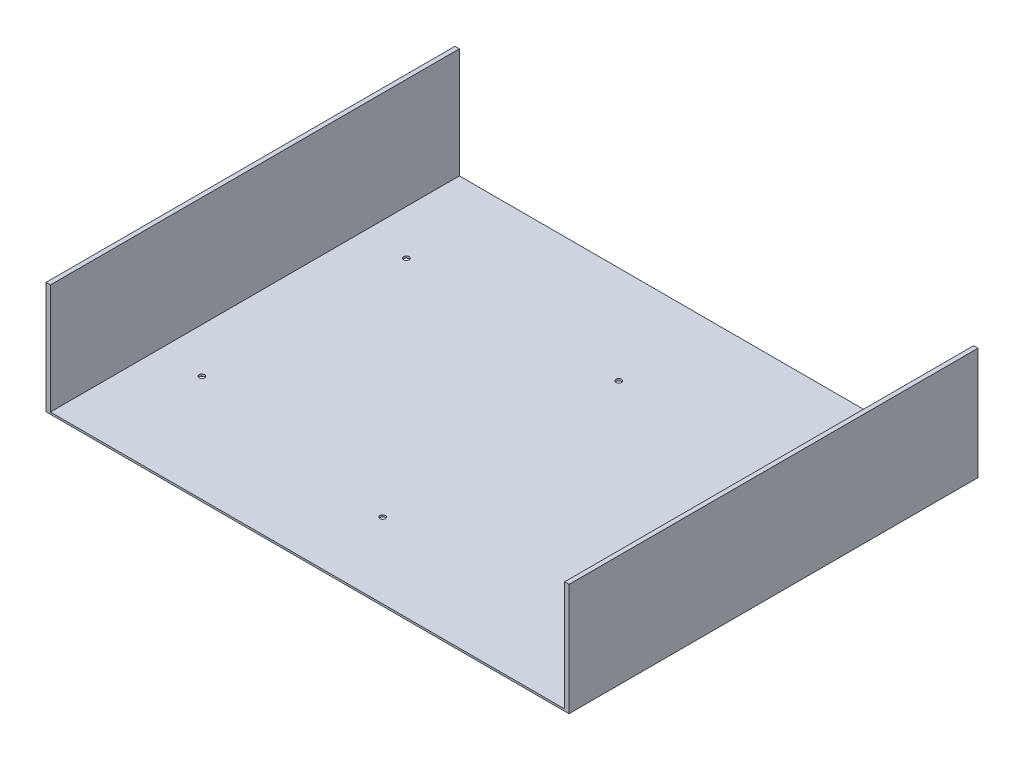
ISO-10303-21;
HEADER;
FILE_DESCRIPTION(('STEP AP214'),'2;1');
FILE_NAME('part.step','',(''),(''),'','','');
FILE_SCHEMA(('AUTOMOTIVE_DESIGN { 1 0 10303 214 1 1 1 1 }'));
ENDSEC;
DATA;
#1=APPLICATION_CONTEXT('core data for automotive mechanical design processes');
#2=APPLICATION_PROTOCOL_DEFINITION('international standard','automotive_design',2000,#1);
#3=PRODUCT_CONTEXT('',#1,'mechanical');
#4=PRODUCT('Part','Part','',(#3));
#5=PRODUCT_RELATED_PRODUCT_CATEGORY('part','',(#4));
#6=PRODUCT_DEFINITION_FORMATION('','',#4);
#7=PRODUCT_DEFINITION_CONTEXT('part definition',#1,'design');
#8=PRODUCT_DEFINITION('design','',#6,#7);
#9=PRODUCT_DEFINITION_SHAPE('','',#8);
#10=(LENGTH_UNIT() NAMED_UNIT(*) SI_UNIT(.MILLI.,.METRE.));
#11=(NAMED_UNIT(*) PLANE_ANGLE_UNIT() SI_UNIT($,.RADIAN.));
#12=(NAMED_UNIT(*) SI_UNIT($,.STERADIAN.) SOLID_ANGLE_UNIT());
#13=UNCERTAINTY_MEASURE_WITH_UNIT(LENGTH_MEASURE(1.E-05),#10,'distance_accuracy_value','');
#14=(GEOMETRIC_REPRESENTATION_CONTEXT(3) GLOBAL_UNCERTAINTY_ASSIGNED_CONTEXT((#13)) GLOBAL_UNIT_ASSIGNED_CONTEXT((#10,
#11,#12)) REPRESENTATION_CONTEXT('',''));
#15=CARTESIAN_POINT('',(0.,0.,0.));
#16=DIRECTION('',(0.,0.,1.));
#17=DIRECTION('',(1.,0.,0.));
#18=AXIS2_PLACEMENT_3D('',#15,#16,#17);
#19=CARTESIAN_POINT('',(0.,1.5875,0.));
#20=DIRECTION('',(0.,-1.,0.));
#21=DIRECTION('',(0.,0.,-1.));
#22=AXIS2_PLACEMENT_3D('',#19,#20,#21);
#23=PLANE('',#22);
#24=CARTESIAN_POINT('',(39.6875,1.5875,-251.2822));
#25=DIRECTION('',(0.,1.,0.));
#26=DIRECTION('',(0.,0.,1.));
#27=AXIS2_PLACEMENT_3D('',#24,#25,#26);
#28=CIRCLE('',#27,2.24789999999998);
#29=CARTESIAN_POINT('',(39.6875,1.5875,-249.0343));
#30=VERTEX_POINT('',#29);
#31=EDGE_CURVE('E350',#30,#30,#28,.T.);
#32=ORIENTED_EDGE('',*,*,#31,.F.);
#33=EDGE_LOOP('',(#32));
#34=FACE_BOUND('',#33,.T.);
#35=CARTESIAN_POINT('',(211.1375,1.5875,-251.2822));
#36=DIRECTION('',(0.,1.,0.));
#37=DIRECTION('',(0.,0.,1.));
#38=AXIS2_PLACEMENT_3D('',#35,#36,#37);
#39=CIRCLE('',#38,2.2479);
#40=CARTESIAN_POINT('',(211.1375,1.5875,-249.0343));
#41=VERTEX_POINT('',#40);
#42=EDGE_CURVE('E352',#41,#41,#39,.T.);
#43=ORIENTED_EDGE('',*,*,#42,.F.);
#44=EDGE_LOOP('',(#43));
#45=FACE_BOUND('',#44,.T.);
#46=CARTESIAN_POINT('',(382.5875,1.5875,-251.2822));
#47=DIRECTION('',(0.,1.,0.));
#48=DIRECTION('',(0.,0.,1.));
#49=AXIS2_PLACEMENT_3D('',#46,#47,#48);
#50=CIRCLE('',#49,2.24789999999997);
#51=CARTESIAN_POINT('',(382.5875,1.5875,-249.0343));
#52=VERTEX_POINT('',#51);
#53=EDGE_CURVE('E360',#52,#52,#50,.T.);
#54=ORIENTED_EDGE('',*,*,#53,.F.);
#55=EDGE_LOOP('',(#54));
#56=FACE_BOUND('',#55,.T.);
#57=CARTESIAN_POINT('',(382.5875,1.5875,-60.7822000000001));
#58=DIRECTION('',(0.,1.,0.));
#59=DIRECTION('',(0.,0.,1.));
#60=AXIS2_PLACEMENT_3D('',#57,#58,#59);
#61=CIRCLE('',#60,2.24789999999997);
#62=CARTESIAN_POINT('',(382.5875,1.5875,-58.5343000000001));
#63=VERTEX_POINT('',#62);
#64=EDGE_CURVE('E366',#63,#63,#61,.T.);
#65=ORIENTED_EDGE('',*,*,#64,.F.);
#66=EDGE_LOOP('',(#65));
#67=FACE_BOUND('',#66,.T.);
#68=CARTESIAN_POINT('',(211.1375,1.5875,-60.7822));
#69=DIRECTION('',(0.,1.,0.));
#70=DIRECTION('',(0.,0.,1.));
#71=AXIS2_PLACEMENT_3D('',#68,#69,#70);
#72=CIRCLE('',#71,2.2479);
#73=CARTESIAN_POINT('',(211.1375,1.5875,-58.5343));
#74=VERTEX_POINT('',#73);
#75=EDGE_CURVE('E372',#74,#74,#72,.T.);
#76=ORIENTED_EDGE('',*,*,#75,.F.);
#77=EDGE_LOOP('',(#76));
#78=FACE_BOUND('',#77,.T.);
#79=CARTESIAN_POINT('',(39.6875,1.5875,-86.1822));
#80=DIRECTION('',(0.,1.,0.));
#81=DIRECTION('',(0.,0.,1.));
#82=AXIS2_PLACEMENT_3D('',#79,#80,#81);
#83=CIRCLE('',#82,2.24789999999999);
#84=CARTESIAN_POINT('',(39.6875,1.5875,-83.9343));
#85=VERTEX_POINT('',#84);
#86=EDGE_CURVE('E377',#85,#85,#83,.T.);
#87=ORIENTED_EDGE('',*,*,#86,.F.);
#88=EDGE_LOOP('',(#87));
#89=FACE_BOUND('',#88,.T.);
#90=DIRECTION('',(0.,0.,1.));
#91=VECTOR('',#90,1.);
#92=CARTESIAN_POINT('',(418.719,1.5875,-330.2));
#93=LINE('',#92,#91);
#94=CARTESIAN_POINT('',(418.719,1.5875,-330.2));
#95=VERTEX_POINT('',#94);
#96=CARTESIAN_POINT('',(418.719,1.5875,0.));
#97=VERTEX_POINT('',#96);
#98=EDGE_CURVE('E124',#95,#97,#93,.T.);
#99=ORIENTED_EDGE('',*,*,#98,.F.);
#100=DIRECTION('',(-1.,0.,0.));
#101=VECTOR('',#100,1.);
#102=CARTESIAN_POINT('',(0.,1.5875,-330.2));
#103=LINE('',#102,#101);
#104=CARTESIAN_POINT('',(3.556,1.5875,-330.2));
#105=VERTEX_POINT('',#104);
#106=EDGE_CURVE('E156',#95,#105,#103,.T.);
#107=ORIENTED_EDGE('',*,*,#106,.T.);
#108=DIRECTION('',(0.,0.,-1.));
#109=VECTOR('',#108,1.);
#110=CARTESIAN_POINT('',(3.556,1.5875,-330.2));
#111=LINE('',#110,#109);
#112=CARTESIAN_POINT('',(3.55600000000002,1.5875,0.));
#113=VERTEX_POINT('',#112);
#114=EDGE_CURVE('E55',#113,#105,#111,.T.);
#115=ORIENTED_EDGE('',*,*,#114,.F.);
#116=DIRECTION('',(1.,0.,0.));
#117=VECTOR('',#116,1.);
#118=CARTESIAN_POINT('',(0.,1.5875,0.));
#119=LINE('',#118,#117);
#120=EDGE_CURVE('E50',#113,#97,#119,.T.);
#121=ORIENTED_EDGE('',*,*,#120,.T.);
#122=EDGE_LOOP('',(#99,#107,#115,#121));
#123=FACE_BOUND('',#122,.T.);
#124=ADVANCED_FACE('F35',(#34,#45,#56,#67,#78,#89,#123),#23,.F.);
#125=CARTESIAN_POINT('',(0.,1.5875,0.));
#126=DIRECTION('',(1.,0.,0.));
#127=DIRECTION('',(0.,0.,-1.));
#128=AXIS2_PLACEMENT_3D('',#125,#126,#127);
#129=PLANE('',#128);
#130=DIRECTION('',(0.,0.,1.));
#131=VECTOR('',#130,1.);
#132=CARTESIAN_POINT('',(0.,0.,0.));
#133=LINE('',#132,#131);
#134=CARTESIAN_POINT('',(0.,0.,-330.2));
#135=VERTEX_POINT('',#134);
#136=CARTESIAN_POINT('',(0.,0.,0.));
#137=VERTEX_POINT('',#136);
#138=EDGE_CURVE('E154',#135,#137,#133,.T.);
#139=ORIENTED_EDGE('',*,*,#138,.T.);
#140=DIRECTION('',(0.,-1.,0.));
#141=VECTOR('',#140,1.);
#142=CARTESIAN_POINT('',(0.,1.5875,0.));
#143=LINE('',#142,#141);
#144=CARTESIAN_POINT('',(0.,90.4875,0.));
#145=VERTEX_POINT('',#144);
#146=EDGE_CURVE('E11',#145,#137,#143,.T.);
#147=ORIENTED_EDGE('',*,*,#146,.F.);
#148=DIRECTION('',(0.,0.,1.));
#149=VECTOR('',#148,1.);
#150=CARTESIAN_POINT('',(0.,90.4875,-330.2));
#151=LINE('',#150,#149);
#152=CARTESIAN_POINT('',(0.,90.4875,-330.2));
#153=VERTEX_POINT('',#152);
#154=EDGE_CURVE('E137',#153,#145,#151,.T.);
#155=ORIENTED_EDGE('',*,*,#154,.F.);
#156=DIRECTION('',(0.,-1.,0.));
#157=VECTOR('',#156,1.);
#158=CARTESIAN_POINT('',(0.,1.5875,-330.2));
#159=LINE('',#158,#157);
#160=EDGE_CURVE('E109',#153,#135,#159,.T.);
#161=ORIENTED_EDGE('',*,*,#160,.T.);
#162=EDGE_LOOP('',(#139,#147,#155,#161));
#163=FACE_BOUND('',#162,.T.);
#164=ADVANCED_FACE('F37',(#163),#129,.F.);
#165=CARTESIAN_POINT('',(0.,1.5875,0.));
#166=DIRECTION('',(0.,0.,-1.));
#167=DIRECTION('',(-1.,0.,0.));
#168=AXIS2_PLACEMENT_3D('',#165,#166,#167);
#169=PLANE('',#168);
#170=DIRECTION('',(1.,0.,0.));
#171=VECTOR('',#170,1.);
#172=CARTESIAN_POINT('',(0.,0.,0.));
#173=LINE('',#172,#171);
#174=CARTESIAN_POINT('',(422.275,0.,0.));
#175=VERTEX_POINT('',#174);
#176=EDGE_CURVE('E161',#137,#175,#173,.T.);
#177=ORIENTED_EDGE('',*,*,#176,.T.);
#178=DIRECTION('',(0.,-1.,0.));
#179=VECTOR('',#178,1.);
#180=CARTESIAN_POINT('',(422.275,1.5875,0.));
#181=LINE('',#180,#179);
#182=CARTESIAN_POINT('',(422.275,90.4875,0.));
#183=VERTEX_POINT('',#182);
#184=EDGE_CURVE('E43',#183,#175,#181,.T.);
#185=ORIENTED_EDGE('',*,*,#184,.F.);
#186=DIRECTION('',(1.,0.,0.));
#187=VECTOR('',#186,1.);
#188=CARTESIAN_POINT('',(422.275,90.4875,0.));
#189=LINE('',#188,#187);
#190=CARTESIAN_POINT('',(418.719,90.4875,0.));
#191=VERTEX_POINT('',#190);
#192=EDGE_CURVE('E123',#191,#183,#189,.T.);
#193=ORIENTED_EDGE('',*,*,#192,.F.);
#194=DIRECTION('',(0.,-1.,0.));
#195=VECTOR('',#194,1.);
#196=CARTESIAN_POINT('',(418.719,90.4875,0.));
#197=LINE('',#196,#195);
#198=EDGE_CURVE('E132',#191,#97,#197,.T.);
#199=ORIENTED_EDGE('',*,*,#198,.T.);
#200=ORIENTED_EDGE('',*,*,#120,.F.);
#201=DIRECTION('',(0.,-1.,0.));
#202=VECTOR('',#201,1.);
#203=CARTESIAN_POINT('',(3.55600000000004,90.4875,0.));
#204=LINE('',#203,#202);
#205=CARTESIAN_POINT('',(3.55600000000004,90.4875,0.));
#206=VERTEX_POINT('',#205);
#207=EDGE_CURVE('E151',#206,#113,#204,.T.);
#208=ORIENTED_EDGE('',*,*,#207,.F.);
#209=DIRECTION('',(1.,0.,0.));
#210=VECTOR('',#209,1.);
#211=CARTESIAN_POINT('',(0.,90.4875,0.));
#212=LINE('',#211,#210);
#213=EDGE_CURVE('E140',#145,#206,#212,.T.);
#214=ORIENTED_EDGE('',*,*,#213,.F.);
#215=ORIENTED_EDGE('',*,*,#146,.T.);
#216=EDGE_LOOP('',(#177,#185,#193,#199,#200,#208,#214,#215));
#217=FACE_BOUND('',#216,.T.);
#218=ADVANCED_FACE('F181',(#217),#169,.F.);
#219=CARTESIAN_POINT('',(422.275,1.5875,0.));
#220=DIRECTION('',(-1.,0.,0.));
#221=DIRECTION('',(0.,0.,1.));
#222=AXIS2_PLACEMENT_3D('',#219,#220,#221);
#223=PLANE('',#222);
#224=DIRECTION('',(0.,0.,-1.));
#225=VECTOR('',#224,1.);
#226=CARTESIAN_POINT('',(422.275,0.,0.));
#227=LINE('',#226,#225);
#228=CARTESIAN_POINT('',(422.275,0.,-330.2));
#229=VERTEX_POINT('',#228);
#230=EDGE_CURVE('E106',#175,#229,#227,.T.);
#231=ORIENTED_EDGE('',*,*,#230,.T.);
#232=DIRECTION('',(0.,-1.,0.));
#233=VECTOR('',#232,1.);
#234=CARTESIAN_POINT('',(422.275,1.5875,-330.2));
#235=LINE('',#234,#233);
#236=CARTESIAN_POINT('',(422.275,90.4875,-330.2));
#237=VERTEX_POINT('',#236);
#238=EDGE_CURVE('E99',#237,#229,#235,.T.);
#239=ORIENTED_EDGE('',*,*,#238,.F.);
#240=DIRECTION('',(0.,0.,-1.));
#241=VECTOR('',#240,1.);
#242=CARTESIAN_POINT('',(422.275,90.4875,-330.2));
#243=LINE('',#242,#241);
#244=EDGE_CURVE('E104',#183,#237,#243,.T.);
#245=ORIENTED_EDGE('',*,*,#244,.F.);
#246=ORIENTED_EDGE('',*,*,#184,.T.);
#247=EDGE_LOOP('',(#231,#239,#245,#246));
#248=FACE_BOUND('',#247,.T.);
#249=ADVANCED_FACE('F101',(#248),#223,.F.);
#250=CARTESIAN_POINT('',(0.,1.5875,-330.2));
#251=DIRECTION('',(0.,0.,1.));
#252=DIRECTION('',(1.,0.,0.));
#253=AXIS2_PLACEMENT_3D('',#250,#251,#252);
#254=PLANE('',#253);
#255=DIRECTION('',(-1.,0.,0.));
#256=VECTOR('',#255,1.);
#257=CARTESIAN_POINT('',(0.,0.,-330.2));
#258=LINE('',#257,#256);
#259=EDGE_CURVE('E157',#229,#135,#258,.T.);
#260=ORIENTED_EDGE('',*,*,#259,.T.);
#261=ORIENTED_EDGE('',*,*,#160,.F.);
#262=DIRECTION('',(-1.,0.,0.));
#263=VECTOR('',#262,1.);
#264=CARTESIAN_POINT('',(0.,90.4875,-330.2));
#265=LINE('',#264,#263);
#266=CARTESIAN_POINT('',(3.556,90.4875,-330.2));
#267=VERTEX_POINT('',#266);
#268=EDGE_CURVE('E144',#267,#153,#265,.T.);
#269=ORIENTED_EDGE('',*,*,#268,.F.);
#270=DIRECTION('',(0.,-1.,0.));
#271=VECTOR('',#270,1.);
#272=CARTESIAN_POINT('',(3.556,90.4875,-330.2));
#273=LINE('',#272,#271);
#274=EDGE_CURVE('E147',#267,#105,#273,.T.);
#275=ORIENTED_EDGE('',*,*,#274,.T.);
#276=ORIENTED_EDGE('',*,*,#106,.F.);
#277=DIRECTION('',(0.,-1.,0.));
#278=VECTOR('',#277,1.);
#279=CARTESIAN_POINT('',(418.719,90.4875,-330.2));
#280=LINE('',#279,#278);
#281=CARTESIAN_POINT('',(418.719,90.4875,-330.2));
#282=VERTEX_POINT('',#281);
#283=EDGE_CURVE('E115',#282,#95,#280,.T.);
#284=ORIENTED_EDGE('',*,*,#283,.F.);
#285=DIRECTION('',(-1.,0.,0.));
#286=VECTOR('',#285,1.);
#287=CARTESIAN_POINT('',(422.275,90.4875,-330.2));
#288=LINE('',#287,#286);
#289=EDGE_CURVE('E112',#237,#282,#288,.T.);
#290=ORIENTED_EDGE('',*,*,#289,.F.);
#291=ORIENTED_EDGE('',*,*,#238,.T.);
#292=EDGE_LOOP('',(#260,#261,#269,#275,#276,#284,#290,#291));
#293=FACE_BOUND('',#292,.T.);
#294=ADVANCED_FACE('F113',(#293),#254,.F.);
#295=CARTESIAN_POINT('',(0.,0.,0.));
#296=DIRECTION('',(0.,-1.,0.));
#297=DIRECTION('',(0.,0.,-1.));
#298=AXIS2_PLACEMENT_3D('',#295,#296,#297);
#299=PLANE('',#298);
#300=CARTESIAN_POINT('',(39.6875,0.,-251.2822));
#301=DIRECTION('',(0.,1.,0.));
#302=DIRECTION('',(0.,0.,1.));
#303=AXIS2_PLACEMENT_3D('',#300,#301,#302);
#304=CIRCLE('',#303,2.2479);
#305=CARTESIAN_POINT('',(39.6875,0.,-249.0343));
#306=VERTEX_POINT('',#305);
#307=EDGE_CURVE('E348',#306,#306,#304,.T.);
#308=ORIENTED_EDGE('',*,*,#307,.T.);
#309=EDGE_LOOP('',(#308));
#310=FACE_BOUND('',#309,.T.);
#311=CARTESIAN_POINT('',(211.1375,0.,-251.2822));
#312=DIRECTION('',(0.,1.,0.));
#313=DIRECTION('',(0.,0.,1.));
#314=AXIS2_PLACEMENT_3D('',#311,#312,#313);
#315=CIRCLE('',#314,2.2479);
#316=CARTESIAN_POINT('',(211.1375,0.,-249.0343));
#317=VERTEX_POINT('',#316);
#318=EDGE_CURVE('E357',#317,#317,#315,.T.);
#319=ORIENTED_EDGE('',*,*,#318,.T.);
#320=EDGE_LOOP('',(#319));
#321=FACE_BOUND('',#320,.T.);
#322=CARTESIAN_POINT('',(382.5875,0.,-251.2822));
#323=DIRECTION('',(0.,1.,0.));
#324=DIRECTION('',(0.,0.,1.));
#325=AXIS2_PLACEMENT_3D('',#322,#323,#324);
#326=CIRCLE('',#325,2.24789999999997);
#327=CARTESIAN_POINT('',(382.5875,0.,-249.0343));
#328=VERTEX_POINT('',#327);
#329=EDGE_CURVE('E363',#328,#328,#326,.T.);
#330=ORIENTED_EDGE('',*,*,#329,.T.);
#331=EDGE_LOOP('',(#330));
#332=FACE_BOUND('',#331,.T.);
#333=CARTESIAN_POINT('',(382.5875,0.,-60.7822000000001));
#334=DIRECTION('',(0.,1.,0.));
#335=DIRECTION('',(0.,0.,1.));
#336=AXIS2_PLACEMENT_3D('',#333,#334,#335);
#337=CIRCLE('',#336,2.24789999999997);
#338=CARTESIAN_POINT('',(382.5875,0.,-58.5343000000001));
#339=VERTEX_POINT('',#338);
#340=EDGE_CURVE('E369',#339,#339,#337,.T.);
#341=ORIENTED_EDGE('',*,*,#340,.T.);
#342=EDGE_LOOP('',(#341));
#343=FACE_BOUND('',#342,.T.);
#344=CARTESIAN_POINT('',(211.1375,0.,-60.7822));
#345=DIRECTION('',(0.,1.,0.));
#346=DIRECTION('',(0.,0.,1.));
#347=AXIS2_PLACEMENT_3D('',#344,#345,#346);
#348=CIRCLE('',#347,2.2479);
#349=CARTESIAN_POINT('',(211.1375,0.,-58.5343));
#350=VERTEX_POINT('',#349);
#351=EDGE_CURVE('E375',#350,#350,#348,.T.);
#352=ORIENTED_EDGE('',*,*,#351,.T.);
#353=EDGE_LOOP('',(#352));
#354=FACE_BOUND('',#353,.T.);
#355=CARTESIAN_POINT('',(39.6875,0.,-86.1822));
#356=DIRECTION('',(0.,1.,0.));
#357=DIRECTION('',(0.,0.,1.));
#358=AXIS2_PLACEMENT_3D('',#355,#356,#357);
#359=CIRCLE('',#358,2.2479);
#360=CARTESIAN_POINT('',(39.6875,0.,-83.9343));
#361=VERTEX_POINT('',#360);
#362=EDGE_CURVE('E126',#361,#361,#359,.T.);
#363=ORIENTED_EDGE('',*,*,#362,.T.);
#364=EDGE_LOOP('',(#363));
#365=FACE_BOUND('',#364,.T.);
#366=ORIENTED_EDGE('',*,*,#138,.F.);
#367=ORIENTED_EDGE('',*,*,#259,.F.);
#368=ORIENTED_EDGE('',*,*,#230,.F.);
#369=ORIENTED_EDGE('',*,*,#176,.F.);
#370=EDGE_LOOP('',(#366,#367,#368,#369));
#371=FACE_BOUND('',#370,.T.);
#372=ADVANCED_FACE('F169',(#310,#321,#332,#343,#354,#365,#371),#299,.T.);
#373=CARTESIAN_POINT('',(3.556,90.4875,-330.2));
#374=DIRECTION('',(-1.,0.,0.));
#375=DIRECTION('',(0.,0.,1.));
#376=AXIS2_PLACEMENT_3D('',#373,#374,#375);
#377=PLANE('',#376);
#378=ORIENTED_EDGE('',*,*,#114,.T.);
#379=ORIENTED_EDGE('',*,*,#274,.F.);
#380=DIRECTION('',(0.,0.,-1.));
#381=VECTOR('',#380,1.);
#382=CARTESIAN_POINT('',(3.556,90.4875,-330.2));
#383=LINE('',#382,#381);
#384=EDGE_CURVE('E142',#206,#267,#383,.T.);
#385=ORIENTED_EDGE('',*,*,#384,.F.);
#386=ORIENTED_EDGE('',*,*,#207,.T.);
#387=EDGE_LOOP('',(#378,#379,#385,#386));
#388=FACE_BOUND('',#387,.T.);
#389=ADVANCED_FACE('F180',(#388),#377,.F.);
#390=CARTESIAN_POINT('',(0.,90.4875,0.));
#391=DIRECTION('',(0.,1.,0.));
#392=DIRECTION('',(0.,0.,1.));
#393=AXIS2_PLACEMENT_3D('',#390,#391,#392);
#394=PLANE('',#393);
#395=ORIENTED_EDGE('',*,*,#154,.T.);
#396=ORIENTED_EDGE('',*,*,#213,.T.);
#397=ORIENTED_EDGE('',*,*,#384,.T.);
#398=ORIENTED_EDGE('',*,*,#268,.T.);
#399=EDGE_LOOP('',(#395,#396,#397,#398));
#400=FACE_BOUND('',#399,.T.);
#401=ADVANCED_FACE('F175',(#400),#394,.T.);
#402=CARTESIAN_POINT('',(418.719,90.4875,-330.2));
#403=DIRECTION('',(1.,0.,0.));
#404=DIRECTION('',(0.,0.,-1.));
#405=AXIS2_PLACEMENT_3D('',#402,#403,#404);
#406=PLANE('',#405);
#407=ORIENTED_EDGE('',*,*,#98,.T.);
#408=ORIENTED_EDGE('',*,*,#198,.F.);
#409=DIRECTION('',(0.,0.,1.));
#410=VECTOR('',#409,1.);
#411=CARTESIAN_POINT('',(418.719,90.4875,-330.2));
#412=LINE('',#411,#410);
#413=EDGE_CURVE('E118',#282,#191,#412,.T.);
#414=ORIENTED_EDGE('',*,*,#413,.F.);
#415=ORIENTED_EDGE('',*,*,#283,.T.);
#416=EDGE_LOOP('',(#407,#408,#414,#415));
#417=FACE_BOUND('',#416,.T.);
#418=ADVANCED_FACE('F184',(#417),#406,.F.);
#419=CARTESIAN_POINT('',(0.,90.4875,0.));
#420=DIRECTION('',(0.,-1.,0.));
#421=DIRECTION('',(0.,0.,-1.));
#422=AXIS2_PLACEMENT_3D('',#419,#420,#421);
#423=PLANE('',#422);
#424=ORIENTED_EDGE('',*,*,#244,.T.);
#425=ORIENTED_EDGE('',*,*,#289,.T.);
#426=ORIENTED_EDGE('',*,*,#413,.T.);
#427=ORIENTED_EDGE('',*,*,#192,.T.);
#428=EDGE_LOOP('',(#424,#425,#426,#427));
#429=FACE_BOUND('',#428,.T.);
#430=ADVANCED_FACE('F121',(#429),#423,.F.);
#431=CARTESIAN_POINT('',(39.6875,1.5875,-86.1822));
#432=DIRECTION('',(0.,1.,0.));
#433=DIRECTION('',(0.,0.,1.));
#434=AXIS2_PLACEMENT_3D('',#431,#432,#433);
#435=CYLINDRICAL_SURFACE('',#434,2.24789999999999);
#436=ORIENTED_EDGE('',*,*,#362,.F.);
#437=EDGE_LOOP('',(#436));
#438=FACE_BOUND('',#437,.T.);
#439=ORIENTED_EDGE('',*,*,#86,.T.);
#440=EDGE_LOOP('',(#439));
#441=FACE_BOUND('',#440,.T.);
#442=ADVANCED_FACE('F246',(#438,#441),#435,.F.);
#443=CARTESIAN_POINT('',(211.1375,1.5875,-60.7822));
#444=DIRECTION('',(0.,1.,0.));
#445=DIRECTION('',(0.,0.,1.));
#446=AXIS2_PLACEMENT_3D('',#443,#444,#445);
#447=CYLINDRICAL_SURFACE('',#446,2.2479);
#448=ORIENTED_EDGE('',*,*,#351,.F.);
#449=EDGE_LOOP('',(#448));
#450=FACE_BOUND('',#449,.T.);
#451=ORIENTED_EDGE('',*,*,#75,.T.);
#452=EDGE_LOOP('',(#451));
#453=FACE_BOUND('',#452,.T.);
#454=ADVANCED_FACE('F252',(#450,#453),#447,.F.);
#455=CARTESIAN_POINT('',(382.5875,1.5875,-60.7822000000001));
#456=DIRECTION('',(0.,1.,0.));
#457=DIRECTION('',(0.,0.,1.));
#458=AXIS2_PLACEMENT_3D('',#455,#456,#457);
#459=CYLINDRICAL_SURFACE('',#458,2.24789999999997);
#460=ORIENTED_EDGE('',*,*,#340,.F.);
#461=EDGE_LOOP('',(#460));
#462=FACE_BOUND('',#461,.T.);
#463=ORIENTED_EDGE('',*,*,#64,.T.);
#464=EDGE_LOOP('',(#463));
#465=FACE_BOUND('',#464,.T.);
#466=ADVANCED_FACE('F260',(#462,#465),#459,.F.);
#467=CARTESIAN_POINT('',(382.5875,1.5875,-251.2822));
#468=DIRECTION('',(0.,1.,0.));
#469=DIRECTION('',(0.,0.,1.));
#470=AXIS2_PLACEMENT_3D('',#467,#468,#469);
#471=CYLINDRICAL_SURFACE('',#470,2.24789999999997);
#472=ORIENTED_EDGE('',*,*,#329,.F.);
#473=EDGE_LOOP('',(#472));
#474=FACE_BOUND('',#473,.T.);
#475=ORIENTED_EDGE('',*,*,#53,.T.);
#476=EDGE_LOOP('',(#475));
#477=FACE_BOUND('',#476,.T.);
#478=ADVANCED_FACE('F268',(#474,#477),#471,.F.);
#479=CARTESIAN_POINT('',(211.1375,1.5875,-251.2822));
#480=DIRECTION('',(0.,1.,0.));
#481=DIRECTION('',(0.,0.,1.));
#482=AXIS2_PLACEMENT_3D('',#479,#480,#481);
#483=CYLINDRICAL_SURFACE('',#482,2.2479);
#484=ORIENTED_EDGE('',*,*,#318,.F.);
#485=EDGE_LOOP('',(#484));
#486=FACE_BOUND('',#485,.T.);
#487=ORIENTED_EDGE('',*,*,#42,.T.);
#488=EDGE_LOOP('',(#487));
#489=FACE_BOUND('',#488,.T.);
#490=ADVANCED_FACE('F276',(#486,#489),#483,.F.);
#491=CARTESIAN_POINT('',(39.6875,1.5875,-251.2822));
#492=DIRECTION('',(0.,1.,0.));
#493=DIRECTION('',(0.,0.,1.));
#494=AXIS2_PLACEMENT_3D('',#491,#492,#493);
#495=CYLINDRICAL_SURFACE('',#494,2.24789999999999);
#496=ORIENTED_EDGE('',*,*,#307,.F.);
#497=EDGE_LOOP('',(#496));
#498=FACE_BOUND('',#497,.T.);
#499=ORIENTED_EDGE('',*,*,#31,.T.);
#500=EDGE_LOOP('',(#499));
#501=FACE_BOUND('',#500,.T.);
#502=ADVANCED_FACE('F284',(#498,#501),#495,.F.);
#503=CLOSED_SHELL('',(#124,#164,#218,#249,#294,#372,#389,#401,#418,#430,#442,#454,#466,#478,
#490,#502));
#504=MANIFOLD_SOLID_BREP('B2',#503);
#505=ADVANCED_BREP_SHAPE_REPRESENTATION('',(#18,#504),#14);
#506=SHAPE_DEFINITION_REPRESENTATION(#9,#505);
ENDSEC;
END-ISO-10303-21;
